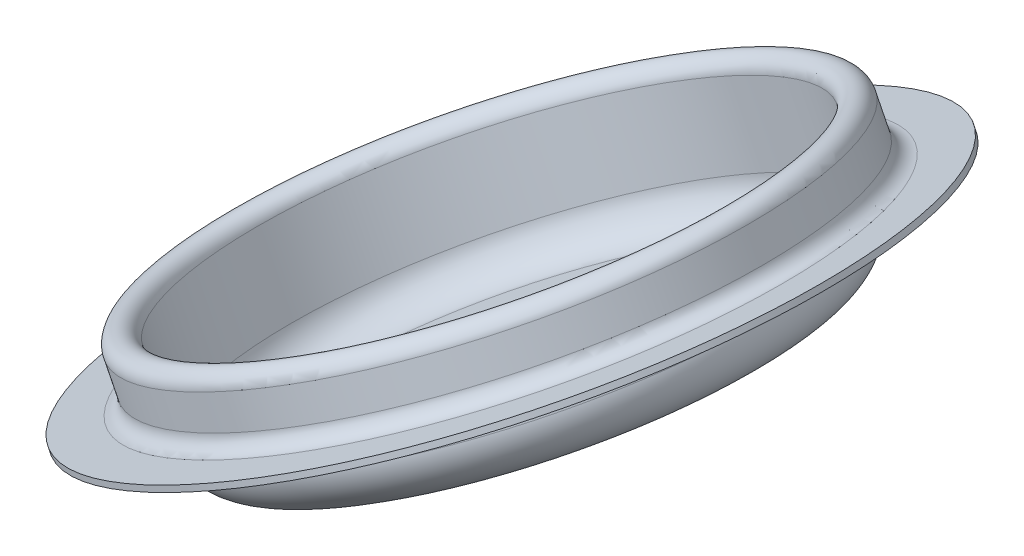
ISO-10303-21;
HEADER;
FILE_DESCRIPTION(('STEP AP214'),'2;1');
FILE_NAME('part.step','',(''),(''),'','','');
FILE_SCHEMA(('AUTOMOTIVE_DESIGN { 1 0 10303 214 1 1 1 1 }'));
ENDSEC;
DATA;
#1=APPLICATION_CONTEXT('core data for automotive mechanical design processes');
#2=APPLICATION_PROTOCOL_DEFINITION('international standard','automotive_design',2000,#1);
#3=PRODUCT_CONTEXT('',#1,'mechanical');
#4=PRODUCT('Part','Part','',(#3));
#5=PRODUCT_RELATED_PRODUCT_CATEGORY('part','',(#4));
#6=PRODUCT_DEFINITION_FORMATION('','',#4);
#7=PRODUCT_DEFINITION_CONTEXT('part definition',#1,'design');
#8=PRODUCT_DEFINITION('design','',#6,#7);
#9=PRODUCT_DEFINITION_SHAPE('','',#8);
#10=(LENGTH_UNIT() NAMED_UNIT(*) SI_UNIT(.MILLI.,.METRE.));
#11=(NAMED_UNIT(*) PLANE_ANGLE_UNIT() SI_UNIT($,.RADIAN.));
#12=(NAMED_UNIT(*) SI_UNIT($,.STERADIAN.) SOLID_ANGLE_UNIT());
#13=UNCERTAINTY_MEASURE_WITH_UNIT(LENGTH_MEASURE(1.E-05),#10,'distance_accuracy_value','');
#14=(GEOMETRIC_REPRESENTATION_CONTEXT(3) GLOBAL_UNCERTAINTY_ASSIGNED_CONTEXT((#13)) GLOBAL_UNIT_ASSIGNED_CONTEXT((#10,
#11,#12)) REPRESENTATION_CONTEXT('',''));
#15=CARTESIAN_POINT('',(0.,0.,0.));
#16=DIRECTION('',(0.,0.,1.));
#17=DIRECTION('',(1.,0.,0.));
#18=AXIS2_PLACEMENT_3D('',#15,#16,#17);
#19=CARTESIAN_POINT('',(-21.345320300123,119.402431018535,0.));
#20=DIRECTION('',(0.449375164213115,-0.893343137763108,0.));
#21=DIRECTION('',(0.893343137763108,0.449375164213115,0.));
#22=AXIS2_PLACEMENT_3D('',#19,#20,#21);
#23=TOROIDAL_SURFACE('',#22,23.75,1.25);
#24=CARTESIAN_POINT('',(-21.345320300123,119.402431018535,0.));
#25=DIRECTION('',(0.449375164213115,-0.893343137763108,0.));
#26=DIRECTION('',(0.893343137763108,0.449375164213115,0.));
#27=AXIS2_PLACEMENT_3D('',#24,#25,#26);
#28=CIRCLE('',#27,22.5);
#29=CARTESIAN_POINT('',(-1.24509970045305,129.51337221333,0.));
#30=VERTEX_POINT('',#29);
#31=EDGE_CURVE('E10',#30,#30,#28,.T.);
#32=ORIENTED_EDGE('',*,*,#31,.T.);
#33=EDGE_LOOP('',(#32));
#34=FACE_BOUND('',#33,.T.);
#35=CARTESIAN_POINT('',(-21.345320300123,119.402431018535,0.));
#36=DIRECTION('',(0.449375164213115,-0.893343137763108,0.));
#37=DIRECTION('',(0.893343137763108,0.449375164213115,0.));
#38=AXIS2_PLACEMENT_3D('',#35,#36,#37);
#39=CIRCLE('',#38,25.);
#40=CARTESIAN_POINT('',(0.988258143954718,130.636810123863,0.));
#41=VERTEX_POINT('',#40);
#42=EDGE_CURVE('E421',#41,#41,#39,.T.);
#43=ORIENTED_EDGE('',*,*,#42,.F.);
#44=EDGE_LOOP('',(#43));
#45=FACE_BOUND('',#44,.T.);
#46=ADVANCED_FACE('F369',(#34,#45),#23,.T.);
#47=CARTESIAN_POINT('',(18.8737568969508,39.4482201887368,0.));
#48=DIRECTION('',(0.449375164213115,-0.893343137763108,0.));
#49=DIRECTION('',(0.893343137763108,0.449375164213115,0.));
#50=AXIS2_PLACEMENT_3D('',#47,#48,#49);
#51=CYLINDRICAL_SURFACE('',#50,22.5);
#52=CARTESIAN_POINT('',(-18.4243817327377,113.595700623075,0.));
#53=DIRECTION('',(0.449375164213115,-0.893343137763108,0.));
#54=DIRECTION('',(0.893343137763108,0.449375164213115,0.));
#55=AXIS2_PLACEMENT_3D('',#52,#53,#54);
#56=CIRCLE('',#55,22.5);
#57=CARTESIAN_POINT('',(1.6758388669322,123.70664181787,0.));
#58=VERTEX_POINT('',#57);
#59=EDGE_CURVE('E375',#58,#58,#56,.T.);
#60=ORIENTED_EDGE('',*,*,#59,.T.);
#61=EDGE_LOOP('',(#60));
#62=FACE_BOUND('',#61,.T.);
#63=ORIENTED_EDGE('',*,*,#31,.F.);
#64=EDGE_LOOP('',(#63));
#65=FACE_BOUND('',#64,.T.);
#66=ADVANCED_FACE('F429',(#62,#65),#51,.F.);
#67=CARTESIAN_POINT('',(-18.4243817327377,113.595700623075,0.));
#68=DIRECTION('',(0.449375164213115,-0.893343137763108,0.));
#69=DIRECTION('',(0.893343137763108,0.449375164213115,0.));
#70=AXIS2_PLACEMENT_3D('',#67,#68,#69);
#71=TOROIDAL_SURFACE('',#70,19.5,3.);
#72=CARTESIAN_POINT('',(-17.0762562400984,110.915671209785,0.));
#73=DIRECTION('',(0.449375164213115,-0.893343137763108,0.));
#74=DIRECTION('',(0.893343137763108,0.449375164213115,0.));
#75=AXIS2_PLACEMENT_3D('',#72,#73,#74);
#76=CIRCLE('',#75,19.5);
#77=CARTESIAN_POINT('',(0.343934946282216,119.678486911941,0.));
#78=VERTEX_POINT('',#77);
#79=EDGE_CURVE('E379',#78,#78,#76,.T.);
#80=ORIENTED_EDGE('',*,*,#79,.T.);
#81=EDGE_LOOP('',(#80));
#82=FACE_BOUND('',#81,.T.);
#83=ORIENTED_EDGE('',*,*,#59,.F.);
#84=EDGE_LOOP('',(#83));
#85=FACE_BOUND('',#84,.T.);
#86=ADVANCED_FACE('F433',(#82,#85),#71,.F.);
#87=CARTESIAN_POINT('',(-14.8428983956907,112.039109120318,0.));
#88=DIRECTION('',(-0.449375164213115,0.893343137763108,0.));
#89=DIRECTION('',(-0.893343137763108,-0.449375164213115,0.));
#90=AXIS2_PLACEMENT_3D('',#87,#88,#89);
#91=PLANE('',#90);
#92=CARTESIAN_POINT('',(-17.0762562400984,110.915671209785,0.));
#93=DIRECTION('',(0.449375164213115,-0.893343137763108,0.));
#94=DIRECTION('',(0.893343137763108,0.449375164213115,0.));
#95=AXIS2_PLACEMENT_3D('',#92,#93,#94);
#96=CIRCLE('',#95,2.49999999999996);
#97=CARTESIAN_POINT('',(-14.8428983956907,112.039109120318,0.));
#98=VERTEX_POINT('',#97);
#99=EDGE_CURVE('E383',#98,#98,#96,.T.);
#100=ORIENTED_EDGE('',*,*,#99,.T.);
#101=EDGE_LOOP('',(#100));
#102=FACE_BOUND('',#101,.T.);
#103=ORIENTED_EDGE('',*,*,#79,.F.);
#104=EDGE_LOOP('',(#103));
#105=FACE_BOUND('',#104,.T.);
#106=ADVANCED_FACE('F437',(#102,#105),#91,.T.);
#107=CARTESIAN_POINT('',(18.8737568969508,39.4482201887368,0.));
#108=DIRECTION('',(0.449375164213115,-0.893343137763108,0.));
#109=DIRECTION('',(0.893343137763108,0.449375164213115,0.));
#110=AXIS2_PLACEMENT_3D('',#107,#108,#109);
#111=CYLINDRICAL_SURFACE('',#110,2.49999999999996);
#112=CARTESIAN_POINT('',(-16.8515686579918,110.468999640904,0.));
#113=DIRECTION('',(0.449375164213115,-0.893343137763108,0.));
#114=DIRECTION('',(0.893343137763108,0.449375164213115,0.));
#115=AXIS2_PLACEMENT_3D('',#112,#113,#114);
#116=CIRCLE('',#115,2.49999999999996);
#117=CARTESIAN_POINT('',(-14.6182108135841,111.592437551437,0.));
#118=VERTEX_POINT('',#117);
#119=EDGE_CURVE('E388',#118,#118,#116,.T.);
#120=ORIENTED_EDGE('',*,*,#119,.T.);
#121=EDGE_LOOP('',(#120));
#122=FACE_BOUND('',#121,.T.);
#123=ORIENTED_EDGE('',*,*,#99,.F.);
#124=EDGE_LOOP('',(#123));
#125=FACE_BOUND('',#124,.T.);
#126=ADVANCED_FACE('F444',(#122,#125),#111,.F.);
#127=CARTESIAN_POINT('',(0.568622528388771,119.23181534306,0.));
#128=DIRECTION('',(0.449375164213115,-0.893343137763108,0.));
#129=DIRECTION('',(0.893343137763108,0.449375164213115,0.));
#130=AXIS2_PLACEMENT_3D('',#127,#128,#129);
#131=PLANE('',#130);
#132=CARTESIAN_POINT('',(-16.8515686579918,110.468999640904,0.));
#133=DIRECTION('',(0.449375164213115,-0.893343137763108,0.));
#134=DIRECTION('',(0.893343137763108,0.449375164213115,0.));
#135=AXIS2_PLACEMENT_3D('',#132,#133,#134);
#136=CIRCLE('',#135,19.5);
#137=CARTESIAN_POINT('',(0.568622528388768,119.23181534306,0.));
#138=VERTEX_POINT('',#137);
#139=EDGE_CURVE('E391',#138,#138,#136,.T.);
#140=ORIENTED_EDGE('',*,*,#139,.T.);
#141=EDGE_LOOP('',(#140));
#142=FACE_BOUND('',#141,.T.);
#143=ORIENTED_EDGE('',*,*,#119,.F.);
#144=EDGE_LOOP('',(#143));
#145=FACE_BOUND('',#144,.T.);
#146=ADVANCED_FACE('F448',(#142,#145),#131,.T.);
#147=CARTESIAN_POINT('',(-18.4243817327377,113.595700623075,0.));
#148=DIRECTION('',(0.449375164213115,-0.893343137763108,0.));
#149=DIRECTION('',(0.893343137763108,0.449375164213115,0.));
#150=AXIS2_PLACEMENT_3D('',#147,#148,#149);
#151=TOROIDAL_SURFACE('',#150,19.5,3.5);
#152=CARTESIAN_POINT('',(-18.4243817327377,113.595700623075,0.));
#153=DIRECTION('',(0.449375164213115,-0.893343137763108,0.));
#154=DIRECTION('',(0.893343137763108,0.449375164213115,0.));
#155=AXIS2_PLACEMENT_3D('',#152,#153,#154);
#156=CIRCLE('',#155,23.);
#157=CARTESIAN_POINT('',(2.12251043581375,123.931329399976,0.));
#158=VERTEX_POINT('',#157);
#159=EDGE_CURVE('E394',#158,#158,#156,.T.);
#160=ORIENTED_EDGE('',*,*,#159,.T.);
#161=EDGE_LOOP('',(#160));
#162=FACE_BOUND('',#161,.T.);
#163=ORIENTED_EDGE('',*,*,#139,.F.);
#164=EDGE_LOOP('',(#163));
#165=FACE_BOUND('',#164,.T.);
#166=ADVANCED_FACE('F452',(#162,#165),#151,.T.);
#167=CARTESIAN_POINT('',(18.8737568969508,39.4482201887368,0.));
#168=DIRECTION('',(0.449375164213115,-0.893343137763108,0.));
#169=DIRECTION('',(0.893343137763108,0.449375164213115,0.));
#170=AXIS2_PLACEMENT_3D('',#167,#168,#169);
#171=CYLINDRICAL_SURFACE('',#170,23.);
#172=CARTESIAN_POINT('',(-21.345320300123,119.402431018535,0.));
#173=DIRECTION('',(0.449375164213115,-0.893343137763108,0.));
#174=DIRECTION('',(0.893343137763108,0.449375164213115,0.));
#175=AXIS2_PLACEMENT_3D('',#172,#173,#174);
#176=CIRCLE('',#175,23.);
#177=CARTESIAN_POINT('',(-0.79842813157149,129.738059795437,0.));
#178=VERTEX_POINT('',#177);
#179=EDGE_CURVE('E397',#178,#178,#176,.T.);
#180=ORIENTED_EDGE('',*,*,#179,.T.);
#181=EDGE_LOOP('',(#180));
#182=FACE_BOUND('',#181,.T.);
#183=ORIENTED_EDGE('',*,*,#159,.F.);
#184=EDGE_LOOP('',(#183));
#185=FACE_BOUND('',#184,.T.);
#186=ADVANCED_FACE('F456',(#182,#185),#171,.T.);
#187=CARTESIAN_POINT('',(-21.345320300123,119.402431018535,0.));
#188=DIRECTION('',(0.449375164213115,-0.893343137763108,0.));
#189=DIRECTION('',(0.893343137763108,0.449375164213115,0.));
#190=AXIS2_PLACEMENT_3D('',#187,#188,#189);
#191=TOROIDAL_SURFACE('',#190,23.75,0.749999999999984);
#192=CARTESIAN_POINT('',(-21.345320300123,119.402431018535,0.));
#193=DIRECTION('',(0.449375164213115,-0.893343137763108,0.));
#194=DIRECTION('',(0.893343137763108,0.449375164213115,0.));
#195=AXIS2_PLACEMENT_3D('',#192,#193,#194);
#196=CIRCLE('',#195,24.5);
#197=CARTESIAN_POINT('',(0.541586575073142,130.412122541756,0.));
#198=VERTEX_POINT('',#197);
#199=EDGE_CURVE('E400',#198,#198,#196,.T.);
#200=ORIENTED_EDGE('',*,*,#199,.T.);
#201=EDGE_LOOP('',(#200));
#202=FACE_BOUND('',#201,.T.);
#203=ORIENTED_EDGE('',*,*,#179,.F.);
#204=EDGE_LOOP('',(#203));
#205=FACE_BOUND('',#204,.T.);
#206=ADVANCED_FACE('F460',(#202,#205),#191,.F.);
#207=CARTESIAN_POINT('',(18.8737568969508,39.4482201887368,0.));
#208=DIRECTION('',(0.449375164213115,-0.893343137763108,0.));
#209=DIRECTION('',(0.893343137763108,0.449375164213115,0.));
#210=AXIS2_PLACEMENT_3D('',#207,#208,#209);
#211=CYLINDRICAL_SURFACE('',#210,24.5);
#212=CARTESIAN_POINT('',(-20.1095385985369,116.945737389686,0.));
#213=DIRECTION('',(0.449375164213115,-0.893343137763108,0.));
#214=DIRECTION('',(0.893343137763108,0.449375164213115,0.));
#215=AXIS2_PLACEMENT_3D('',#212,#213,#214);
#216=CIRCLE('',#215,24.5);
#217=CARTESIAN_POINT('',(1.77736827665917,127.955428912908,0.));
#218=VERTEX_POINT('',#217);
#219=EDGE_CURVE('E403',#218,#218,#216,.T.);
#220=ORIENTED_EDGE('',*,*,#219,.T.);
#221=EDGE_LOOP('',(#220));
#222=FACE_BOUND('',#221,.T.);
#223=ORIENTED_EDGE('',*,*,#199,.F.);
#224=EDGE_LOOP('',(#223));
#225=FACE_BOUND('',#224,.T.);
#226=ADVANCED_FACE('F464',(#222,#225),#211,.F.);
#227=CARTESIAN_POINT('',(-20.1095385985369,116.945737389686,0.));
#228=DIRECTION('',(0.449375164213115,-0.893343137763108,0.));
#229=DIRECTION('',(0.893343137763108,0.449375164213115,0.));
#230=AXIS2_PLACEMENT_3D('',#227,#228,#229);
#231=TOROIDAL_SURFACE('',#230,26.25,1.75000000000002);
#232=CARTESIAN_POINT('',(-19.323132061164,115.382386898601,0.));
#233=DIRECTION('',(0.449375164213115,-0.893343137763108,0.));
#234=DIRECTION('',(0.893343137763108,0.449375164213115,0.));
#235=AXIS2_PLACEMENT_3D('',#232,#233,#234);
#236=CIRCLE('',#235,26.25);
#237=CARTESIAN_POINT('',(4.12712530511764,127.178484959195,0.));
#238=VERTEX_POINT('',#237);
#239=EDGE_CURVE('E406',#238,#238,#236,.T.);
#240=ORIENTED_EDGE('',*,*,#239,.T.);
#241=EDGE_LOOP('',(#240));
#242=FACE_BOUND('',#241,.T.);
#243=ORIENTED_EDGE('',*,*,#219,.F.);
#244=EDGE_LOOP('',(#243));
#245=FACE_BOUND('',#244,.T.);
#246=ADVANCED_FACE('F468',(#242,#245),#231,.T.);
#247=CARTESIAN_POINT('',(4.12712530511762,127.178484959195,0.));
#248=DIRECTION('',(0.449375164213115,-0.893343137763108,0.));
#249=DIRECTION('',(0.893343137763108,0.449375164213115,0.));
#250=AXIS2_PLACEMENT_3D('',#247,#248,#249);
#251=PLANE('',#250);
#252=CARTESIAN_POINT('',(-19.323132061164,115.382386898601,0.));
#253=DIRECTION('',(0.449375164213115,-0.893343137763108,0.));
#254=DIRECTION('',(0.893343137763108,0.449375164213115,0.));
#255=AXIS2_PLACEMENT_3D('',#252,#253,#254);
#256=CIRCLE('',#255,30.);
#257=CARTESIAN_POINT('',(7.47716207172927,128.863641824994,0.));
#258=VERTEX_POINT('',#257);
#259=EDGE_CURVE('E409',#258,#258,#256,.T.);
#260=ORIENTED_EDGE('',*,*,#259,.T.);
#261=EDGE_LOOP('',(#260));
#262=FACE_BOUND('',#261,.T.);
#263=ORIENTED_EDGE('',*,*,#239,.F.);
#264=EDGE_LOOP('',(#263));
#265=FACE_BOUND('',#264,.T.);
#266=ADVANCED_FACE('F472',(#262,#265),#251,.T.);
#267=CARTESIAN_POINT('',(18.8737568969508,39.4482201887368,0.));
#268=DIRECTION('',(0.449375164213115,-0.893343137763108,0.));
#269=DIRECTION('',(0.893343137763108,0.449375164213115,0.));
#270=AXIS2_PLACEMENT_3D('',#267,#268,#269);
#271=CYLINDRICAL_SURFACE('',#270,30.);
#272=CARTESIAN_POINT('',(-19.5478196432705,115.829058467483,0.));
#273=DIRECTION('',(0.449375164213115,-0.893343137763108,0.));
#274=DIRECTION('',(0.893343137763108,0.449375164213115,0.));
#275=AXIS2_PLACEMENT_3D('',#272,#273,#274);
#276=CIRCLE('',#275,30.);
#277=CARTESIAN_POINT('',(7.2524744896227,129.310313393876,0.));
#278=VERTEX_POINT('',#277);
#279=EDGE_CURVE('E412',#278,#278,#276,.T.);
#280=ORIENTED_EDGE('',*,*,#279,.T.);
#281=EDGE_LOOP('',(#280));
#282=FACE_BOUND('',#281,.T.);
#283=ORIENTED_EDGE('',*,*,#259,.F.);
#284=EDGE_LOOP('',(#283));
#285=FACE_BOUND('',#284,.T.);
#286=ADVANCED_FACE('F476',(#282,#285),#271,.T.);
#287=CARTESIAN_POINT('',(3.90243772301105,127.625156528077,0.));
#288=DIRECTION('',(-0.449375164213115,0.893343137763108,0.));
#289=DIRECTION('',(-0.893343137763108,-0.449375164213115,0.));
#290=AXIS2_PLACEMENT_3D('',#287,#288,#289);
#291=PLANE('',#290);
#292=CARTESIAN_POINT('',(-19.5478196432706,115.829058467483,0.));
#293=DIRECTION('',(0.449375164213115,-0.893343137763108,0.));
#294=DIRECTION('',(0.893343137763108,0.449375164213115,0.));
#295=AXIS2_PLACEMENT_3D('',#292,#293,#294);
#296=CIRCLE('',#295,26.25);
#297=CARTESIAN_POINT('',(3.90243772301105,127.625156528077,0.));
#298=VERTEX_POINT('',#297);
#299=EDGE_CURVE('E415',#298,#298,#296,.T.);
#300=ORIENTED_EDGE('',*,*,#299,.T.);
#301=EDGE_LOOP('',(#300));
#302=FACE_BOUND('',#301,.T.);
#303=ORIENTED_EDGE('',*,*,#279,.F.);
#304=EDGE_LOOP('',(#303));
#305=FACE_BOUND('',#304,.T.);
#306=ADVANCED_FACE('F480',(#302,#305),#291,.T.);
#307=CARTESIAN_POINT('',(-20.1095385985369,116.945737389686,0.));
#308=DIRECTION('',(0.449375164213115,-0.893343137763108,0.));
#309=DIRECTION('',(0.893343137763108,0.449375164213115,0.));
#310=AXIS2_PLACEMENT_3D('',#307,#308,#309);
#311=TOROIDAL_SURFACE('',#310,26.25,1.24999999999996);
#312=CARTESIAN_POINT('',(-20.1095385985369,116.945737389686,0.));
#313=DIRECTION('',(0.449375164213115,-0.893343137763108,0.));
#314=DIRECTION('',(0.893343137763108,0.449375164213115,0.));
#315=AXIS2_PLACEMENT_3D('',#312,#313,#314);
#316=CIRCLE('',#315,25.);
#317=CARTESIAN_POINT('',(2.22403984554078,128.180116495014,0.));
#318=VERTEX_POINT('',#317);
#319=EDGE_CURVE('E418',#318,#318,#316,.T.);
#320=ORIENTED_EDGE('',*,*,#319,.T.);
#321=EDGE_LOOP('',(#320));
#322=FACE_BOUND('',#321,.T.);
#323=ORIENTED_EDGE('',*,*,#299,.F.);
#324=EDGE_LOOP('',(#323));
#325=FACE_BOUND('',#324,.T.);
#326=ADVANCED_FACE('F484',(#322,#325),#311,.F.);
#327=CARTESIAN_POINT('',(18.8737568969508,39.4482201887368,0.));
#328=DIRECTION('',(0.449375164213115,-0.893343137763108,0.));
#329=DIRECTION('',(0.893343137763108,0.449375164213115,0.));
#330=AXIS2_PLACEMENT_3D('',#327,#328,#329);
#331=CYLINDRICAL_SURFACE('',#330,25.);
#332=ORIENTED_EDGE('',*,*,#42,.T.);
#333=EDGE_LOOP('',(#332));
#334=FACE_BOUND('',#333,.T.);
#335=ORIENTED_EDGE('',*,*,#319,.F.);
#336=EDGE_LOOP('',(#335));
#337=FACE_BOUND('',#336,.T.);
#338=ADVANCED_FACE('F425',(#334,#337),#331,.T.);
#339=CLOSED_SHELL('',(#46,#66,#86,#106,#126,#146,#166,#186,#206,#226,#246,#266,#286,#306,#326,#338));
#340=MANIFOLD_SOLID_BREP('B2',#339);
#341=ADVANCED_BREP_SHAPE_REPRESENTATION('',(#18,#340),#14);
#342=SHAPE_DEFINITION_REPRESENTATION(#9,#341);
ENDSEC;
END-ISO-10303-21;
